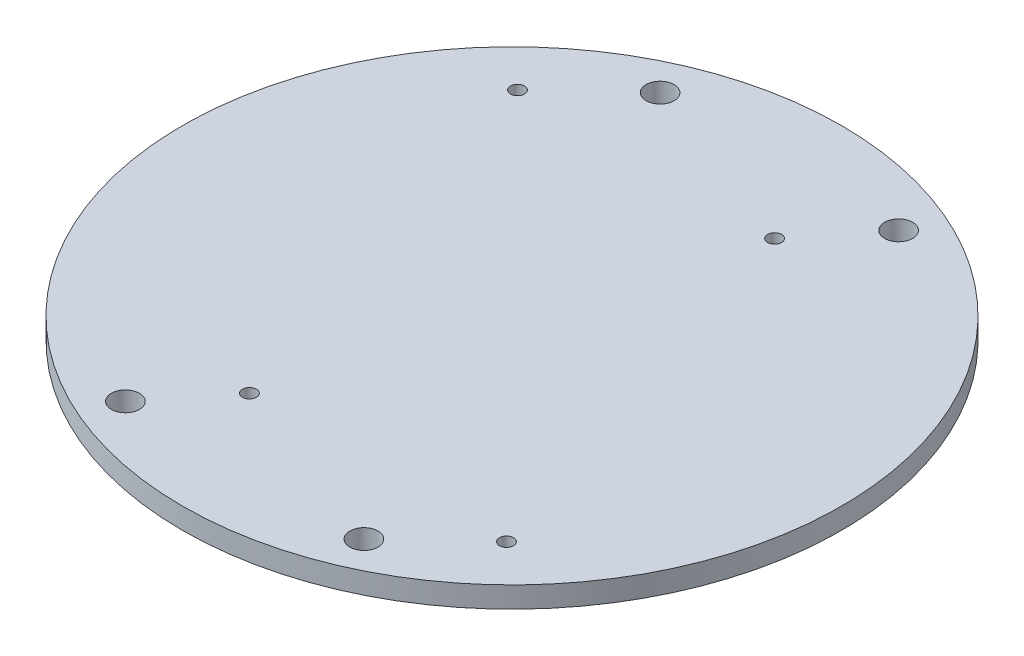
ISO-10303-21;
HEADER;
FILE_DESCRIPTION(('STEP AP214'),'2;1');
FILE_NAME('part.step','',(''),(''),'','','');
FILE_SCHEMA(('AUTOMOTIVE_DESIGN { 1 0 10303 214 1 1 1 1 }'));
ENDSEC;
DATA;
#1=APPLICATION_CONTEXT('core data for automotive mechanical design processes');
#2=APPLICATION_PROTOCOL_DEFINITION('international standard','automotive_design',2000,#1);
#3=PRODUCT_CONTEXT('',#1,'mechanical');
#4=PRODUCT('Part','Part','',(#3));
#5=PRODUCT_RELATED_PRODUCT_CATEGORY('part','',(#4));
#6=PRODUCT_DEFINITION_FORMATION('','',#4);
#7=PRODUCT_DEFINITION_CONTEXT('part definition',#1,'design');
#8=PRODUCT_DEFINITION('design','',#6,#7);
#9=PRODUCT_DEFINITION_SHAPE('','',#8);
#10=(LENGTH_UNIT() NAMED_UNIT(*) SI_UNIT(.MILLI.,.METRE.));
#11=(NAMED_UNIT(*) PLANE_ANGLE_UNIT() SI_UNIT($,.RADIAN.));
#12=(NAMED_UNIT(*) SI_UNIT($,.STERADIAN.) SOLID_ANGLE_UNIT());
#13=UNCERTAINTY_MEASURE_WITH_UNIT(LENGTH_MEASURE(1.E-05),#10,'distance_accuracy_value','');
#14=(GEOMETRIC_REPRESENTATION_CONTEXT(3) GLOBAL_UNCERTAINTY_ASSIGNED_CONTEXT((#13)) GLOBAL_UNIT_ASSIGNED_CONTEXT((#10,
#11,#12)) REPRESENTATION_CONTEXT('',''));
#15=CARTESIAN_POINT('',(0.,0.,0.));
#16=DIRECTION('',(0.,0.,1.));
#17=DIRECTION('',(1.,0.,0.));
#18=AXIS2_PLACEMENT_3D('',#15,#16,#17);
#19=CARTESIAN_POINT('',(0.,1.5,0.));
#20=DIRECTION('',(0.,-1.,0.));
#21=DIRECTION('',(0.,0.,-1.));
#22=AXIS2_PLACEMENT_3D('',#19,#20,#21);
#23=CYLINDRICAL_SURFACE('',#22,47.);
#24=CARTESIAN_POINT('',(0.,1.5,0.));
#25=DIRECTION('',(0.,1.,0.));
#26=DIRECTION('',(0.,0.,1.));
#27=AXIS2_PLACEMENT_3D('',#24,#25,#26);
#28=CIRCLE('',#27,47.);
#29=CARTESIAN_POINT('',(0.,1.5,47.));
#30=VERTEX_POINT('',#29);
#31=EDGE_CURVE('E10',#30,#30,#28,.T.);
#32=ORIENTED_EDGE('',*,*,#31,.F.);
#33=EDGE_LOOP('',(#32));
#34=FACE_BOUND('',#33,.T.);
#35=CARTESIAN_POINT('',(0.,-1.5,0.));
#36=DIRECTION('',(0.,1.,0.));
#37=DIRECTION('',(0.,0.,1.));
#38=AXIS2_PLACEMENT_3D('',#35,#36,#37);
#39=CIRCLE('',#38,47.);
#40=CARTESIAN_POINT('',(0.,-1.5,47.));
#41=VERTEX_POINT('',#40);
#42=EDGE_CURVE('E34',#41,#41,#39,.T.);
#43=ORIENTED_EDGE('',*,*,#42,.T.);
#44=EDGE_LOOP('',(#43));
#45=FACE_BOUND('',#44,.T.);
#46=ADVANCED_FACE('F31',(#34,#45),#23,.T.);
#47=CARTESIAN_POINT('',(0.,1.5,0.));
#48=DIRECTION('',(0.,1.,0.));
#49=DIRECTION('',(0.,0.,1.));
#50=AXIS2_PLACEMENT_3D('',#47,#48,#49);
#51=PLANE('',#50);
#52=CARTESIAN_POINT('',(-17.0092592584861,1.5,38.1280421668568));
#53=DIRECTION('',(0.,1.,0.));
#54=DIRECTION('',(0.,0.,-1.));
#55=AXIS2_PLACEMENT_3D('',#52,#53,#54);
#56=CIRCLE('',#55,2.);
#57=CARTESIAN_POINT('',(-17.0092592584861,1.5,36.1280421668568));
#58=VERTEX_POINT('',#57);
#59=EDGE_CURVE('E85',#58,#58,#56,.T.);
#60=ORIENTED_EDGE('',*,*,#59,.F.);
#61=EDGE_LOOP('',(#60));
#62=FACE_BOUND('',#61,.T.);
#63=CARTESIAN_POINT('',(-17.009259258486,1.5,-38.1280421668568));
#64=DIRECTION('',(0.,1.,0.));
#65=DIRECTION('',(0.,0.,1.));
#66=AXIS2_PLACEMENT_3D('',#63,#64,#65);
#67=CIRCLE('',#66,2.);
#68=CARTESIAN_POINT('',(-17.009259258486,1.5,-36.1280421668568));
#69=VERTEX_POINT('',#68);
#70=EDGE_CURVE('E79',#69,#69,#67,.T.);
#71=ORIENTED_EDGE('',*,*,#70,.F.);
#72=EDGE_LOOP('',(#71));
#73=FACE_BOUND('',#72,.T.);
#74=CARTESIAN_POINT('',(17.009259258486,1.5,-38.1280421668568));
#75=DIRECTION('',(0.,1.,0.));
#76=DIRECTION('',(0.,0.,-1.));
#77=AXIS2_PLACEMENT_3D('',#74,#75,#76);
#78=CIRCLE('',#77,2.);
#79=CARTESIAN_POINT('',(17.009259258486,1.5,-40.1280421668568));
#80=VERTEX_POINT('',#79);
#81=EDGE_CURVE('E73',#80,#80,#78,.T.);
#82=ORIENTED_EDGE('',*,*,#81,.F.);
#83=EDGE_LOOP('',(#82));
#84=FACE_BOUND('',#83,.T.);
#85=CARTESIAN_POINT('',(17.0092592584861,1.5,38.1280421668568));
#86=DIRECTION('',(0.,1.,0.));
#87=DIRECTION('',(0.,0.,1.));
#88=AXIS2_PLACEMENT_3D('',#85,#86,#87);
#89=CIRCLE('',#88,2.);
#90=CARTESIAN_POINT('',(17.0092592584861,1.5,40.1280421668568));
#91=VERTEX_POINT('',#90);
#92=EDGE_CURVE('E67',#91,#91,#89,.T.);
#93=ORIENTED_EDGE('',*,*,#92,.F.);
#94=EDGE_LOOP('',(#93));
#95=FACE_BOUND('',#94,.T.);
#96=CARTESIAN_POINT('',(-27.4999999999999,1.5,-28.2842712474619));
#97=DIRECTION('',(0.,1.,0.));
#98=DIRECTION('',(0.,0.,1.));
#99=AXIS2_PLACEMENT_3D('',#96,#97,#98);
#100=CIRCLE('',#99,1.);
#101=CARTESIAN_POINT('',(-27.4999999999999,1.5,-27.2842712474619));
#102=VERTEX_POINT('',#101);
#103=EDGE_CURVE('E61',#102,#102,#100,.T.);
#104=ORIENTED_EDGE('',*,*,#103,.F.);
#105=EDGE_LOOP('',(#104));
#106=FACE_BOUND('',#105,.T.);
#107=CARTESIAN_POINT('',(-9.16666666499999,1.5,28.2842712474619));
#108=DIRECTION('',(0.,1.,0.));
#109=DIRECTION('',(0.,0.,1.));
#110=AXIS2_PLACEMENT_3D('',#107,#108,#109);
#111=CIRCLE('',#110,1.);
#112=CARTESIAN_POINT('',(-9.16666666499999,1.5,29.2842712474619));
#113=VERTEX_POINT('',#112);
#114=EDGE_CURVE('E55',#113,#113,#111,.T.);
#115=ORIENTED_EDGE('',*,*,#114,.F.);
#116=EDGE_LOOP('',(#115));
#117=FACE_BOUND('',#116,.T.);
#118=CARTESIAN_POINT('',(9.16666666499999,1.5,-28.2842712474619));
#119=DIRECTION('',(0.,1.,0.));
#120=DIRECTION('',(0.,0.,1.));
#121=AXIS2_PLACEMENT_3D('',#118,#119,#120);
#122=CIRCLE('',#121,1.);
#123=CARTESIAN_POINT('',(9.16666666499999,1.5,-27.2842712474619));
#124=VERTEX_POINT('',#123);
#125=EDGE_CURVE('E49',#124,#124,#122,.T.);
#126=ORIENTED_EDGE('',*,*,#125,.F.);
#127=EDGE_LOOP('',(#126));
#128=FACE_BOUND('',#127,.T.);
#129=CARTESIAN_POINT('',(27.4999999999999,1.5,28.2842712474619));
#130=DIRECTION('',(0.,1.,0.));
#131=DIRECTION('',(0.,0.,1.));
#132=AXIS2_PLACEMENT_3D('',#129,#130,#131);
#133=CIRCLE('',#132,0.999999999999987);
#134=CARTESIAN_POINT('',(27.4999999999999,1.5,29.2842712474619));
#135=VERTEX_POINT('',#134);
#136=EDGE_CURVE('E43',#135,#135,#133,.T.);
#137=ORIENTED_EDGE('',*,*,#136,.F.);
#138=EDGE_LOOP('',(#137));
#139=FACE_BOUND('',#138,.T.);
#140=ORIENTED_EDGE('',*,*,#31,.T.);
#141=EDGE_LOOP('',(#140));
#142=FACE_BOUND('',#141,.T.);
#143=ADVANCED_FACE('F101',(#62,#73,#84,#95,#106,#117,#128,#139,#142),#51,.T.);
#144=CARTESIAN_POINT('',(0.,-1.5,0.));
#145=DIRECTION('',(0.,1.,0.));
#146=DIRECTION('',(0.,0.,1.));
#147=AXIS2_PLACEMENT_3D('',#144,#145,#146);
#148=PLANE('',#147);
#149=CARTESIAN_POINT('',(-17.0092592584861,-1.5,38.1280421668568));
#150=DIRECTION('',(0.,1.,0.));
#151=DIRECTION('',(0.,0.,-1.));
#152=AXIS2_PLACEMENT_3D('',#149,#150,#151);
#153=CIRCLE('',#152,2.);
#154=CARTESIAN_POINT('',(-17.0092592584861,-1.5,36.1280421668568));
#155=VERTEX_POINT('',#154);
#156=EDGE_CURVE('E82',#155,#155,#153,.T.);
#157=ORIENTED_EDGE('',*,*,#156,.T.);
#158=EDGE_LOOP('',(#157));
#159=FACE_BOUND('',#158,.T.);
#160=CARTESIAN_POINT('',(-17.009259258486,-1.5,-38.1280421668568));
#161=DIRECTION('',(0.,1.,0.));
#162=DIRECTION('',(0.,0.,1.));
#163=AXIS2_PLACEMENT_3D('',#160,#161,#162);
#164=CIRCLE('',#163,2.);
#165=CARTESIAN_POINT('',(-17.009259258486,-1.5,-36.1280421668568));
#166=VERTEX_POINT('',#165);
#167=EDGE_CURVE('E76',#166,#166,#164,.T.);
#168=ORIENTED_EDGE('',*,*,#167,.T.);
#169=EDGE_LOOP('',(#168));
#170=FACE_BOUND('',#169,.T.);
#171=CARTESIAN_POINT('',(17.009259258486,-1.5,-38.1280421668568));
#172=DIRECTION('',(0.,1.,0.));
#173=DIRECTION('',(0.,0.,-1.));
#174=AXIS2_PLACEMENT_3D('',#171,#172,#173);
#175=CIRCLE('',#174,2.);
#176=CARTESIAN_POINT('',(17.009259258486,-1.5,-40.1280421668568));
#177=VERTEX_POINT('',#176);
#178=EDGE_CURVE('E70',#177,#177,#175,.T.);
#179=ORIENTED_EDGE('',*,*,#178,.T.);
#180=EDGE_LOOP('',(#179));
#181=FACE_BOUND('',#180,.T.);
#182=CARTESIAN_POINT('',(17.0092592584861,-1.5,38.1280421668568));
#183=DIRECTION('',(0.,1.,0.));
#184=DIRECTION('',(0.,0.,1.));
#185=AXIS2_PLACEMENT_3D('',#182,#183,#184);
#186=CIRCLE('',#185,2.);
#187=CARTESIAN_POINT('',(17.0092592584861,-1.5,40.1280421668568));
#188=VERTEX_POINT('',#187);
#189=EDGE_CURVE('E64',#188,#188,#186,.T.);
#190=ORIENTED_EDGE('',*,*,#189,.T.);
#191=EDGE_LOOP('',(#190));
#192=FACE_BOUND('',#191,.T.);
#193=CARTESIAN_POINT('',(-27.4999999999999,-1.5,-28.2842712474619));
#194=DIRECTION('',(0.,1.,0.));
#195=DIRECTION('',(0.,0.,1.));
#196=AXIS2_PLACEMENT_3D('',#193,#194,#195);
#197=CIRCLE('',#196,1.);
#198=CARTESIAN_POINT('',(-27.4999999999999,-1.5,-27.2842712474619));
#199=VERTEX_POINT('',#198);
#200=EDGE_CURVE('E58',#199,#199,#197,.T.);
#201=ORIENTED_EDGE('',*,*,#200,.T.);
#202=EDGE_LOOP('',(#201));
#203=FACE_BOUND('',#202,.T.);
#204=CARTESIAN_POINT('',(-9.16666666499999,-1.5,28.2842712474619));
#205=DIRECTION('',(0.,1.,0.));
#206=DIRECTION('',(0.,0.,1.));
#207=AXIS2_PLACEMENT_3D('',#204,#205,#206);
#208=CIRCLE('',#207,1.);
#209=CARTESIAN_POINT('',(-9.16666666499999,-1.5,29.2842712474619));
#210=VERTEX_POINT('',#209);
#211=EDGE_CURVE('E52',#210,#210,#208,.T.);
#212=ORIENTED_EDGE('',*,*,#211,.T.);
#213=EDGE_LOOP('',(#212));
#214=FACE_BOUND('',#213,.T.);
#215=CARTESIAN_POINT('',(9.16666666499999,-1.5,-28.2842712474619));
#216=DIRECTION('',(0.,1.,0.));
#217=DIRECTION('',(0.,0.,1.));
#218=AXIS2_PLACEMENT_3D('',#215,#216,#217);
#219=CIRCLE('',#218,1.);
#220=CARTESIAN_POINT('',(9.16666666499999,-1.5,-27.2842712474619));
#221=VERTEX_POINT('',#220);
#222=EDGE_CURVE('E46',#221,#221,#219,.T.);
#223=ORIENTED_EDGE('',*,*,#222,.T.);
#224=EDGE_LOOP('',(#223));
#225=FACE_BOUND('',#224,.T.);
#226=CARTESIAN_POINT('',(27.4999999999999,-1.5,28.2842712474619));
#227=DIRECTION('',(0.,1.,0.));
#228=DIRECTION('',(0.,0.,1.));
#229=AXIS2_PLACEMENT_3D('',#226,#227,#228);
#230=CIRCLE('',#229,0.999999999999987);
#231=CARTESIAN_POINT('',(27.4999999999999,-1.5,29.2842712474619));
#232=VERTEX_POINT('',#231);
#233=EDGE_CURVE('E41',#232,#232,#230,.T.);
#234=ORIENTED_EDGE('',*,*,#233,.T.);
#235=EDGE_LOOP('',(#234));
#236=FACE_BOUND('',#235,.T.);
#237=ORIENTED_EDGE('',*,*,#42,.F.);
#238=EDGE_LOOP('',(#237));
#239=FACE_BOUND('',#238,.T.);
#240=ADVANCED_FACE('F91',(#159,#170,#181,#192,#203,#214,#225,#236,#239),#148,.F.);
#241=CARTESIAN_POINT('',(27.4999999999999,-1.5,28.2842712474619));
#242=DIRECTION('',(0.,1.,0.));
#243=DIRECTION('',(0.,0.,1.));
#244=AXIS2_PLACEMENT_3D('',#241,#242,#243);
#245=CYLINDRICAL_SURFACE('',#244,0.999999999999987);
#246=ORIENTED_EDGE('',*,*,#233,.F.);
#247=EDGE_LOOP('',(#246));
#248=FACE_BOUND('',#247,.T.);
#249=ORIENTED_EDGE('',*,*,#136,.T.);
#250=EDGE_LOOP('',(#249));
#251=FACE_BOUND('',#250,.T.);
#252=ADVANCED_FACE('F119',(#248,#251),#245,.F.);
#253=CARTESIAN_POINT('',(9.16666666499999,-1.5,-28.2842712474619));
#254=DIRECTION('',(0.,1.,0.));
#255=DIRECTION('',(0.,0.,1.));
#256=AXIS2_PLACEMENT_3D('',#253,#254,#255);
#257=CYLINDRICAL_SURFACE('',#256,1.);
#258=ORIENTED_EDGE('',*,*,#222,.F.);
#259=EDGE_LOOP('',(#258));
#260=FACE_BOUND('',#259,.T.);
#261=ORIENTED_EDGE('',*,*,#125,.T.);
#262=EDGE_LOOP('',(#261));
#263=FACE_BOUND('',#262,.T.);
#264=ADVANCED_FACE('F121',(#260,#263),#257,.F.);
#265=CARTESIAN_POINT('',(-9.16666666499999,-1.5,28.2842712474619));
#266=DIRECTION('',(0.,1.,0.));
#267=DIRECTION('',(0.,0.,1.));
#268=AXIS2_PLACEMENT_3D('',#265,#266,#267);
#269=CYLINDRICAL_SURFACE('',#268,1.);
#270=ORIENTED_EDGE('',*,*,#211,.F.);
#271=EDGE_LOOP('',(#270));
#272=FACE_BOUND('',#271,.T.);
#273=ORIENTED_EDGE('',*,*,#114,.T.);
#274=EDGE_LOOP('',(#273));
#275=FACE_BOUND('',#274,.T.);
#276=ADVANCED_FACE('F128',(#272,#275),#269,.F.);
#277=CARTESIAN_POINT('',(-27.4999999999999,-1.5,-28.2842712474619));
#278=DIRECTION('',(0.,1.,0.));
#279=DIRECTION('',(0.,0.,1.));
#280=AXIS2_PLACEMENT_3D('',#277,#278,#279);
#281=CYLINDRICAL_SURFACE('',#280,1.);
#282=ORIENTED_EDGE('',*,*,#200,.F.);
#283=EDGE_LOOP('',(#282));
#284=FACE_BOUND('',#283,.T.);
#285=ORIENTED_EDGE('',*,*,#103,.T.);
#286=EDGE_LOOP('',(#285));
#287=FACE_BOUND('',#286,.T.);
#288=ADVANCED_FACE('F166',(#284,#287),#281,.F.);
#289=CARTESIAN_POINT('',(17.0092592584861,-1.5,38.1280421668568));
#290=DIRECTION('',(0.,1.,0.));
#291=DIRECTION('',(0.,0.,1.));
#292=AXIS2_PLACEMENT_3D('',#289,#290,#291);
#293=CYLINDRICAL_SURFACE('',#292,2.);
#294=ORIENTED_EDGE('',*,*,#189,.F.);
#295=EDGE_LOOP('',(#294));
#296=FACE_BOUND('',#295,.T.);
#297=ORIENTED_EDGE('',*,*,#92,.T.);
#298=EDGE_LOOP('',(#297));
#299=FACE_BOUND('',#298,.T.);
#300=ADVANCED_FACE('F176',(#296,#299),#293,.F.);
#301=CARTESIAN_POINT('',(17.009259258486,-1.5,-38.1280421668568));
#302=DIRECTION('',(0.,1.,0.));
#303=DIRECTION('',(0.,0.,1.));
#304=AXIS2_PLACEMENT_3D('',#301,#302,#303);
#305=CYLINDRICAL_SURFACE('',#304,2.);
#306=ORIENTED_EDGE('',*,*,#178,.F.);
#307=EDGE_LOOP('',(#306));
#308=FACE_BOUND('',#307,.T.);
#309=ORIENTED_EDGE('',*,*,#81,.T.);
#310=EDGE_LOOP('',(#309));
#311=FACE_BOUND('',#310,.T.);
#312=ADVANCED_FACE('F186',(#308,#311),#305,.F.);
#313=CARTESIAN_POINT('',(-17.009259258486,-1.5,-38.1280421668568));
#314=DIRECTION('',(0.,1.,0.));
#315=DIRECTION('',(0.,0.,1.));
#316=AXIS2_PLACEMENT_3D('',#313,#314,#315);
#317=CYLINDRICAL_SURFACE('',#316,2.);
#318=ORIENTED_EDGE('',*,*,#167,.F.);
#319=EDGE_LOOP('',(#318));
#320=FACE_BOUND('',#319,.T.);
#321=ORIENTED_EDGE('',*,*,#70,.T.);
#322=EDGE_LOOP('',(#321));
#323=FACE_BOUND('',#322,.T.);
#324=ADVANCED_FACE('F97',(#320,#323),#317,.F.);
#325=CARTESIAN_POINT('',(-17.0092592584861,-1.5,38.1280421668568));
#326=DIRECTION('',(0.,1.,0.));
#327=DIRECTION('',(0.,0.,1.));
#328=AXIS2_PLACEMENT_3D('',#325,#326,#327);
#329=CYLINDRICAL_SURFACE('',#328,2.);
#330=ORIENTED_EDGE('',*,*,#156,.F.);
#331=EDGE_LOOP('',(#330));
#332=FACE_BOUND('',#331,.T.);
#333=ORIENTED_EDGE('',*,*,#59,.T.);
#334=EDGE_LOOP('',(#333));
#335=FACE_BOUND('',#334,.T.);
#336=ADVANCED_FACE('F94',(#332,#335),#329,.F.);
#337=CLOSED_SHELL('',(#46,#143,#240,#252,#264,#276,#288,#300,#312,#324,#336));
#338=MANIFOLD_SOLID_BREP('B2',#337);
#339=ADVANCED_BREP_SHAPE_REPRESENTATION('',(#18,#338),#14);
#340=SHAPE_DEFINITION_REPRESENTATION(#9,#339);
ENDSEC;
END-ISO-10303-21;
